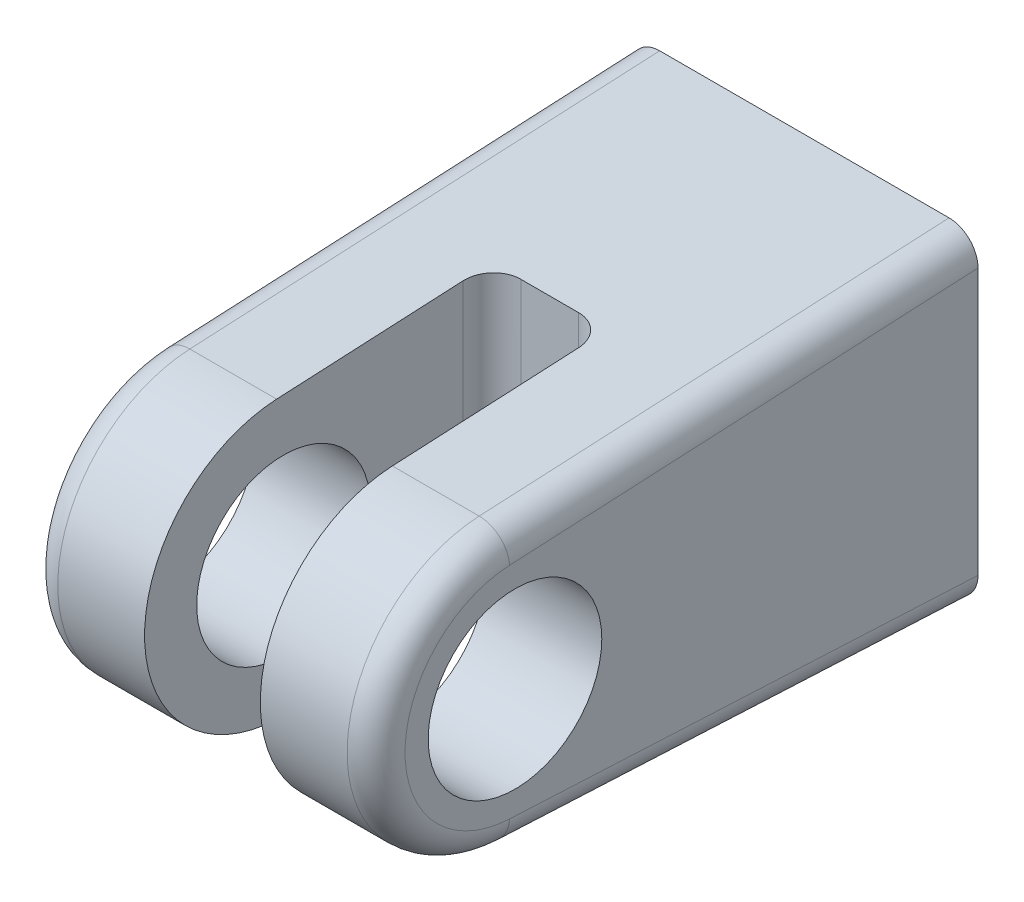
from build123d import *

# Parameters (mm, degrees)
EXTRUDE2_DEPTH          = 9.525
CUT_EXTRUDE1_DEPTH      = 36.497579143
CUT_EXTRUDE1_DEPTH_BACK = 36.497579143
SKETCH3_W               = 6.35
SKETCH3_H               = 19.05
SKETCH4_R               = 4.7625
CUT_EXTRUDE2_DEPTH      = 40.144028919
SKETCH5_R               = 6.35
CUT_EXTRUDE3_DEPTH      = 9.525
FILLET1_R               = 1.5875


with BuildPart() as part:
    # Sketch2 → Extrude2 (new, symmetric)
    with BuildSketch(Plane(origin=(0, 0, 0), x_dir=(0, 0, -1), z_dir=(1, 0, 0))):
        with BuildLine():
            Line((0, 8.89), (-25.777721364, 7.610632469))
            ThreePointArc((-25.777721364, 7.610632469), (-33.02, 0), (-25.777721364, -7.610632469))
            Line((-25.777721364, -7.610632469), (0, -8.89))
            Line((0, -8.89), (0, 8.89))
        make_face()
    extrude(amount=EXTRUDE2_DEPTH, both=True)

    # Sketch3 → Cut-Extrude1 (cut, two sides: drawn at the far end of the back side and taken through both)
    with BuildSketch(Plane(origin=(0, 0, 0), x_dir=(1, 0, 0), z_dir=(0, 1, 0)).offset(-CUT_EXTRUDE1_DEPTH_BACK)):
        with Locations((0, -23.495)):
            Rectangle(SKETCH3_W, SKETCH3_H)
    extrude(amount=CUT_EXTRUDE1_DEPTH + CUT_EXTRUDE1_DEPTH_BACK, mode=Mode.SUBTRACT)

    # Sketch4 → Cut-Extrude2 (cut, through all)
    with BuildSketch(Plane(origin=(9.525, 0, 0), x_dir=(0, 0, -1), z_dir=(1, 0, 0))):
        with Locations((-25.4, 0)):
            Circle(SKETCH4_R)
    extrude(amount=-CUT_EXTRUDE2_DEPTH, mode=Mode.SUBTRACT)

    # Sketch5 → Cut-Extrude3 (cut)
    with BuildSketch(Plane(origin=(0, 0, 0), x_dir=(-1, 0, 0), z_dir=(0, 0, -1))):
        with Locations(Location((0, 0, 0), (0, 0, 90))):
            Circle(SKETCH5_R)
    extrude(amount=-CUT_EXTRUDE3_DEPTH, mode=Mode.SUBTRACT)

    # Fillet1
    fillet1_edges = [part.edges().sort_by_distance(p)[0] for p in [
        (9.525, -8.250316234, 12.888860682),
        (-9.525, -8.250316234, 12.888860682),
        (-9.525, 0, 33.02),
        (-3.175, 0, 13.97),
        (3.175, 0, 13.97),
        (9.525, 0, 33.02),
        (9.525, 8.250316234, 12.888860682),
        (-9.525, 8.250316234, 12.888860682),
    ]]
    fillet(fillet1_edges, radius=FILLET1_R)


solid = part.part
